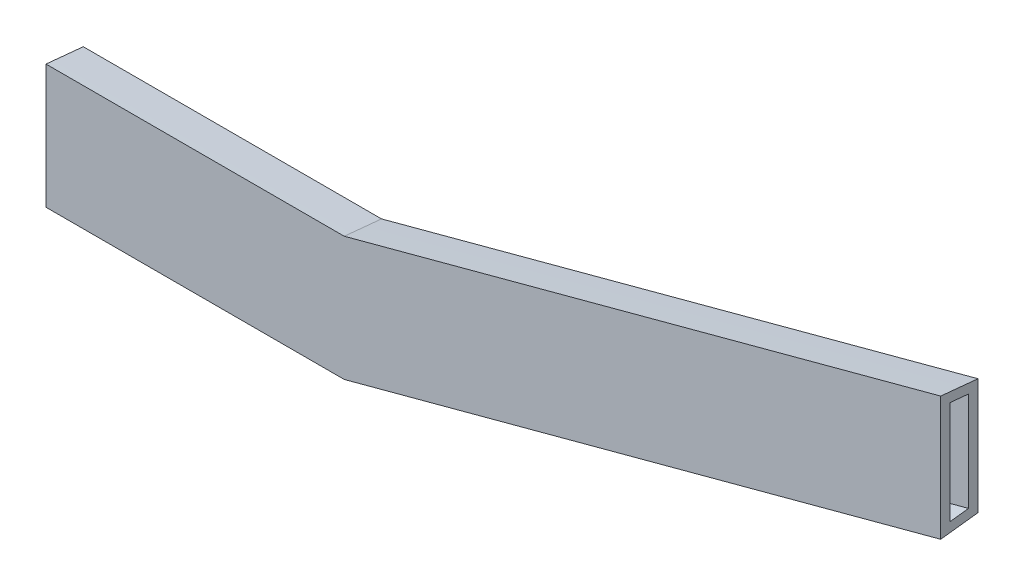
from build123d import *

# Parameters (mm, degrees)
BOSS_EXTRUDE1_DEPTH = 25.4


with BuildPart() as part:
    # Sketch1 → Boss-Extrude1 (new body)
    with BuildSketch(Plane(origin=(0, 0, 0), x_dir=(0, 0, -1), z_dir=(1, 0, 0))):
        with BuildLine():
            Line((64.29375, 17.938061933), (64.29375, 7.373467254))
            add(Edge.make_bspline(
                [(64.29375, 7.373467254), (65.351478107, 7.504041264), (66.409826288, 7.629695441), (67.46875, 7.75018981)],
                knots=[0.728361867, 0.728361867, 0.728361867, 0.728361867, 0.738787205, 0.738787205, 0.738787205, 0.738787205], degree=3))
            Line((67.46875, 7.75018981), (67.46875, 17.629812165))
            add(Edge.make_bspline(
                [(67.46875, 17.629812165), (66.410784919, 17.736286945), (65.352462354, 17.839293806), (64.29375, 17.938061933)],
                knots=[1.266200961, 1.266200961, 1.266200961, 1.266200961, 1.276645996, 1.276645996, 1.276645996, 1.276645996], degree=3))
        make_face()
        with BuildLine():
            Line((65.09385, 17.058887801), (65.09385, 8.277208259))
            add(Edge.make_bspline(
                [(65.09385, 8.277208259), (65.618635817, 8.340583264), (66.143570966, 8.40273425), (66.66865, 8.463632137)],
                knots=[0.731305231, 0.731305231, 0.731305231, 0.731305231, 0.736463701, 0.736463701, 0.736463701, 0.736463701], degree=3))
            Line((66.66865, 8.463632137), (66.66865, 16.905642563))
            add(Edge.make_bspline(
                [(66.66865, 16.905642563), (66.143807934, 16.957653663), (65.61887595, 17.008766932), (65.09385, 17.058887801)],
                knots=[1.268574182, 1.268574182, 1.268574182, 1.268574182, 1.273764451, 1.273764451, 1.273764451, 1.273764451], degree=3))
        make_face(mode=Mode.SUBTRACT)
    extrude(amount=BOSS_EXTRUDE1_DEPTH)

    # Sweep1: sweep along a path in Sketch2
    with BuildLine(Plane.XY.offset(-64.29375)) as sweep1_path:
        Line((25.4, 7.373467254), (76.2, 20.98528623))
    # Sketch3 → Sweep1 (sweep)
    with BuildSketch(Plane(origin=(25.4, 0, 0), x_dir=(0, 0, -1), z_dir=(1, 0, 0))):
        with BuildLine():
            Line((64.29375, 17.938061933), (64.29375, 7.373467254))
            add(Edge.make_bspline(
                [(64.29375, 7.373467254), (65.351478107, 7.504041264), (66.409826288, 7.629695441), (67.46875, 7.75018981)],
                knots=[0.728361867, 0.728361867, 0.728361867, 0.728361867, 0.738787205, 0.738787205, 0.738787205, 0.738787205], degree=3))
            Line((67.46875, 7.75018981), (67.46875, 17.629812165))
            add(Edge.make_bspline(
                [(67.46875, 17.629812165), (66.410784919, 17.736286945), (65.352462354, 17.839293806), (64.29375, 17.938061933)],
                knots=[1.266200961, 1.266200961, 1.266200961, 1.266200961, 1.276645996, 1.276645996, 1.276645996, 1.276645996], degree=3))
        make_face()
        with BuildLine():
            Line((65.09385, 17.058887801), (65.09385, 8.277208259))
            ThreePointArc((65.09385, 8.277208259), (65.881140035, 8.371349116), (66.66865, 8.463632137))
            Line((66.66865, 8.463632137), (66.66865, 16.905642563))
            ThreePointArc((66.66865, 16.905642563), (65.881318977, 16.982974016), (65.09385, 17.058887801))
        make_face(mode=Mode.SUBTRACT)
    sweep(path=sweep1_path.line)


solid = part.part
